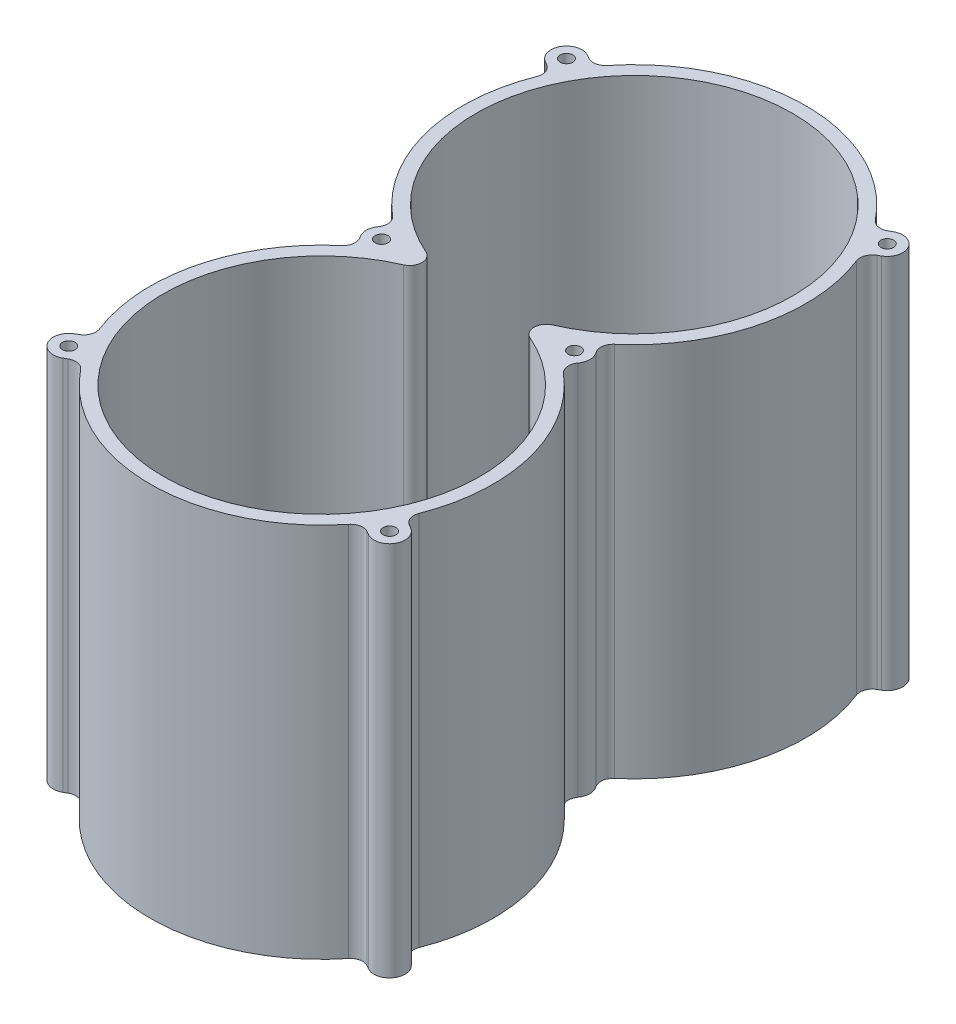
from build123d import *

# Parameters (mm, degrees)
BOSS_EXTRUDE1_DEPTH   = 48.729999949
FILLET1_R             = 3.175
FILLET2_R             = 3.175
BOSS_EXTRUDE2_START   = 97.459999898
BOSS_EXTRUDE2_DEPTH   = 97.459999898
CIRPATTERN1_COUNT     = 2
CIRPATTERN1_ANGLE     = 120
MIRROR7_START         = 97.459999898
MIRROR7_COPY_1_DEPTH  = 97.459999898
FILLET4_R             = 3.175
SKETCH6_R             = 4
BOSS_EXTRUDE3_DEPTH   = 97.459999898
FILLET5_R             = 3.175
M4X0_7_TAPPED_HOLE1_D = 3.3


with BuildPart() as part:
    # Sketch1 → Boss-Extrude1 (new, symmetric)
    with BuildSketch(Plane(origin=(0, 0, 0), x_dir=(1, 0, 0), z_dir=(0, 1, 0))):
        with BuildLine():
            ThreePointArc((18.31809215, 0), (0, 84.95), (-18.31809215, 0))
            ThreePointArc((-18.31809215, 0), (0, -84.95), (18.31809215, 0))
        make_face()
        with BuildLine():
            ThreePointArc((6.517088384, 0), (0, 81.521), (-6.517088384, 0))
            ThreePointArc((-6.517088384, 0), (0, -81.521), (6.517088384, 0))
        make_face(mode=Mode.SUBTRACT)
    extrude(amount=BOSS_EXTRUDE1_DEPTH, both=True)

    # Fillet1
    fillet1_edges = [part.edges().sort_by_distance(p)[0] for p in [
        (-18.31809215, 0, 0),
        (18.31809215, 0, 0),
    ]]
    fillet(fillet1_edges, radius=FILLET1_R)

    # Fillet2
    fillet2_edges = [part.edges().sort_by_distance(p)[0] for p in [
        (-6.517088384, 0, 0),
        (6.517088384, 0, 0),
    ]]
    fillet(fillet2_edges, radius=FILLET2_R)

    # Sketch3 → Boss-Extrude2 (add)
    with BuildSketch(Plane(origin=(0, -48.729999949, 0), x_dir=(1, 0, 0), z_dir=(0, 1, 0)).offset(BOSS_EXTRUDE2_START)):
        with BuildLine():
            Line((-43.569219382, -61.035898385), (-40.338647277, -59.17072671))
            ThreePointArc((-40.338647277, -59.17072671), (-38.494829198, -62.725), (-36.338647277, -66.098929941))
            Line((-36.338647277, -66.098929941), (-39.569219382, -67.964101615))
            ThreePointArc((-39.569219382, -67.964101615), (-45.033320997, -66.5), (-43.569219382, -61.035898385))
        make_face()
    boss_extrude2 = extrude(amount=-BOSS_EXTRUDE2_DEPTH)

    # CirPattern1: Boss-Extrude2 ×2 about axis
    cirpattern1_axis = Axis((0, 0, 40.5), (0, 1, 0))
    for i in range(1, CIRPATTERN1_COUNT):
        add(boss_extrude2.rotate(cirpattern1_axis, i * CIRPATTERN1_ANGLE / (CIRPATTERN1_COUNT - 1)))

    # Mirror7: Boss-Extrude2 across plane
    add(boss_extrude2.mirror(Plane.XY))

    # Mirror7 copy 1 sketch → Mirror7 copy 1 (add)
    with BuildSketch(Plane(origin=(-35.074028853, -48.729999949, -60.75), x_dir=(-0.500000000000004, 0, 0.8660254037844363), z_dir=(0, 1, 0)).offset(MIRROR7_START)):
        with BuildLine():
            Line((-43.569219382, 61.035898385), (-40.338647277, 59.17072671))
            ThreePointArc((-40.338647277, 59.17072671), (-38.494829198, 62.725), (-36.338647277, 66.098929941))
            Line((-36.338647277, 66.098929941), (-39.569219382, 67.964101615))
            ThreePointArc((-39.569219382, 67.964101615), (-45.033320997, 66.5), (-43.569219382, 61.035898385))
        make_face()
    extrude(amount=-MIRROR7_COPY_1_DEPTH)

    # Fillet4
    fillet4_edges = [part.edges().sort_by_distance(p)[0] for p in [
        (-36.338647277, 0, 66.098929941),
        (-40.338647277, 0, 59.17072671),
        (40.338647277, 0, 59.17072671),
        (36.338647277, 0, 66.098929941),
        (-36.338647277, 0, -66.098929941),
        (-40.338647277, 0, -59.17072671),
        (40.338647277, 0, -59.17072671),
        (36.338647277, 0, -66.098929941),
    ]]
    fillet(fillet4_edges, radius=FILLET4_R)

    # Sketch6 → Boss-Extrude3 (add)
    with BuildSketch(Plane.XZ.offset(48.729999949)):
        with Locations((-25, 0)):
            Circle(SKETCH6_R)
        with Locations((25, 0)):
            Circle(SKETCH6_R)
    extrude(amount=-BOSS_EXTRUDE3_DEPTH)

    # Fillet5
    fillet5_edges = [part.edges().sort_by_distance(p)[0] for p in [
        (-25.346667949, 0, -3.984949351),
        (-25.346667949, 0, 3.984949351),
        (25.346667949, 0, -3.984949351),
        (25.346667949, 0, 3.984949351),
    ]]
    fillet(fillet5_edges, radius=FILLET5_R)

    # M4x0.7 Tapped Hole1 (through all)
    with Locations(Plane(origin=(0, -48.729999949, 0), x_dir=(-1, 0, 0), z_dir=(0, -1, 0))):
        with Locations((-25, 0), (-41.569219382, 64.5), (41.569219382, 64.5), (25, 0), (41.569219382, -64.5), (-41.569219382, -64.5)):
            Hole(M4X0_7_TAPPED_HOLE1_D / 2)


solid = part.part
